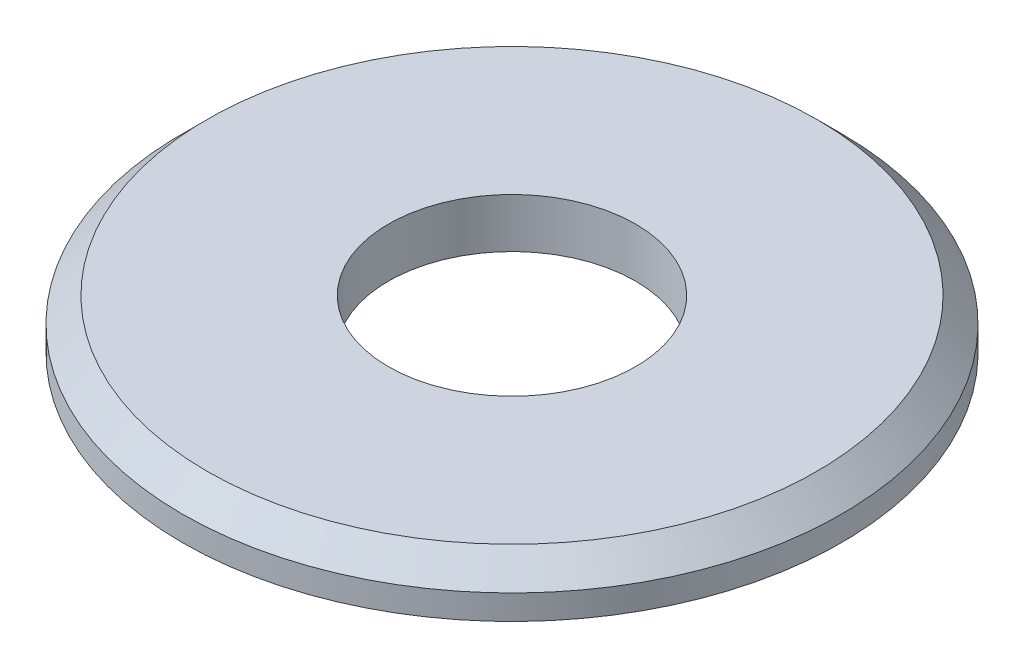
from build123d import *

# Parameters (mm, degrees)
SKETCH1_R      = 2
SKETCH1_R_2    = 0.75
EXTRUDE1_DEPTH = 0.3
CHAMFER1_SIZE  = 0.15


with BuildPart() as part:
    # Sketch1 → Extrude1 (new body)
    with BuildSketch(Plane(origin=(0, 0, 0), x_dir=(1, 0, 0), z_dir=(0, 1, 0))):
        with Locations(Location((0, 0, 0), (0, 0, 270))):
            Circle(SKETCH1_R)
        with Locations(Location((0, 0, 0), (0, 0, 270))):
            Circle(SKETCH1_R_2, mode=Mode.SUBTRACT)
    extrude(amount=EXTRUDE1_DEPTH)

    # Chamfer1
    chamfer1_edges = [part.edges().sort_by_distance(p)[0] for p in [
        (0, 0.3, -2),
    ]]
    chamfer(chamfer1_edges, length=CHAMFER1_SIZE)


solid = part.part
